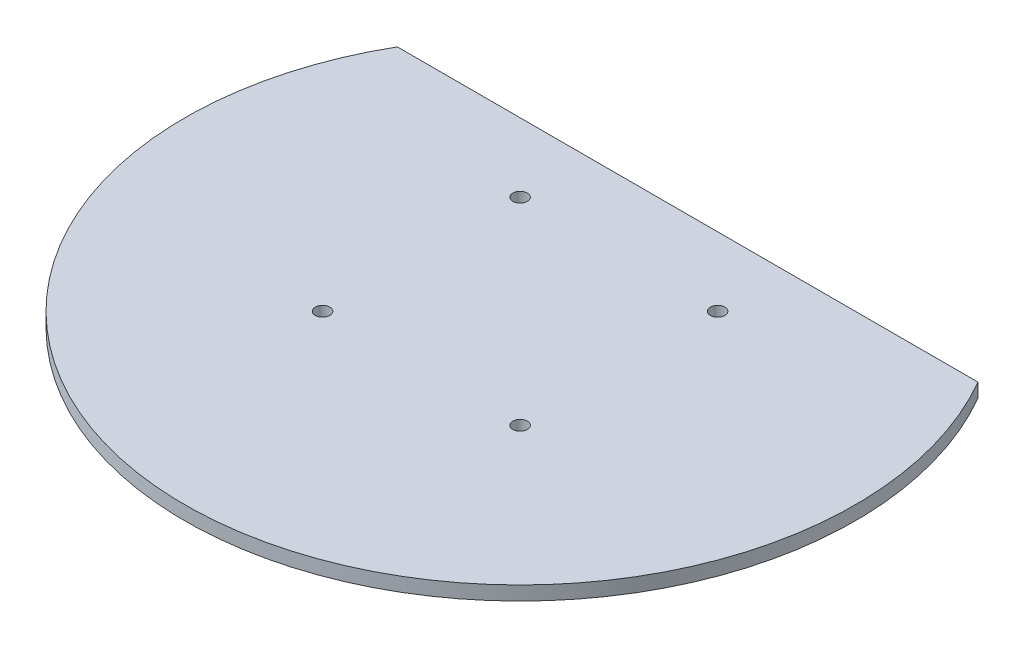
ISO-10303-21;
HEADER;
FILE_DESCRIPTION(('STEP AP214'),'2;1');
FILE_NAME('part.step','',(''),(''),'','','');
FILE_SCHEMA(('AUTOMOTIVE_DESIGN { 1 0 10303 214 1 1 1 1 }'));
ENDSEC;
DATA;
#1=APPLICATION_CONTEXT('core data for automotive mechanical design processes');
#2=APPLICATION_PROTOCOL_DEFINITION('international standard','automotive_design',2000,#1);
#3=PRODUCT_CONTEXT('',#1,'mechanical');
#4=PRODUCT('Part','Part','',(#3));
#5=PRODUCT_RELATED_PRODUCT_CATEGORY('part','',(#4));
#6=PRODUCT_DEFINITION_FORMATION('','',#4);
#7=PRODUCT_DEFINITION_CONTEXT('part definition',#1,'design');
#8=PRODUCT_DEFINITION('design','',#6,#7);
#9=PRODUCT_DEFINITION_SHAPE('','',#8);
#10=(LENGTH_UNIT() NAMED_UNIT(*) SI_UNIT(.MILLI.,.METRE.));
#11=(NAMED_UNIT(*) PLANE_ANGLE_UNIT() SI_UNIT($,.RADIAN.));
#12=(NAMED_UNIT(*) SI_UNIT($,.STERADIAN.) SOLID_ANGLE_UNIT());
#13=UNCERTAINTY_MEASURE_WITH_UNIT(LENGTH_MEASURE(1.E-05),#10,'distance_accuracy_value','');
#14=(GEOMETRIC_REPRESENTATION_CONTEXT(3) GLOBAL_UNCERTAINTY_ASSIGNED_CONTEXT((#13)) GLOBAL_UNIT_ASSIGNED_CONTEXT((#10,
#11,#12)) REPRESENTATION_CONTEXT('',''));
#15=CARTESIAN_POINT('',(0.,0.,0.));
#16=DIRECTION('',(0.,0.,1.));
#17=DIRECTION('',(1.,0.,0.));
#18=AXIS2_PLACEMENT_3D('',#15,#16,#17);
#19=CARTESIAN_POINT('',(0.,6.35,0.));
#20=DIRECTION('',(0.,-1.,0.));
#21=DIRECTION('',(0.,0.,-1.));
#22=AXIS2_PLACEMENT_3D('',#19,#20,#21);
#23=CYLINDRICAL_SURFACE('',#22,152.4);
#24=CARTESIAN_POINT('',(0.,0.,0.));
#25=DIRECTION('',(0.,1.,0.));
#26=DIRECTION('',(0.,0.,1.));
#27=AXIS2_PLACEMENT_3D('',#24,#25,#26);
#28=CIRCLE('',#27,152.4);
#29=CARTESIAN_POINT('',(-131.982271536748,0.,-76.2));
#30=VERTEX_POINT('',#29);
#31=CARTESIAN_POINT('',(131.982271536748,0.,-76.2));
#32=VERTEX_POINT('',#31);
#33=EDGE_CURVE('E62',#30,#32,#28,.T.);
#34=ORIENTED_EDGE('',*,*,#33,.T.);
#35=DIRECTION('',(0.,-1.,0.));
#36=VECTOR('',#35,1.);
#37=CARTESIAN_POINT('',(131.982271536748,6.35,-76.2));
#38=LINE('',#37,#36);
#39=CARTESIAN_POINT('',(131.982271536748,6.35,-76.2));
#40=VERTEX_POINT('',#39);
#41=EDGE_CURVE('E11',#40,#32,#38,.T.);
#42=ORIENTED_EDGE('',*,*,#41,.F.);
#43=CARTESIAN_POINT('',(0.,6.35,0.));
#44=DIRECTION('',(0.,1.,0.));
#45=DIRECTION('',(0.,0.,1.));
#46=AXIS2_PLACEMENT_3D('',#43,#44,#45);
#47=CIRCLE('',#46,152.4);
#48=CARTESIAN_POINT('',(-131.982271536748,6.35,-76.2));
#49=VERTEX_POINT('',#48);
#50=EDGE_CURVE('E61',#49,#40,#47,.T.);
#51=ORIENTED_EDGE('',*,*,#50,.F.);
#52=DIRECTION('',(0.,-1.,0.));
#53=VECTOR('',#52,1.);
#54=CARTESIAN_POINT('',(-131.982271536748,6.35,-76.2));
#55=LINE('',#54,#53);
#56=EDGE_CURVE('E39',#49,#30,#55,.T.);
#57=ORIENTED_EDGE('',*,*,#56,.T.);
#58=EDGE_LOOP('',(#34,#42,#51,#57));
#59=FACE_BOUND('',#58,.T.);
#60=ADVANCED_FACE('F31',(#59),#23,.T.);
#61=CARTESIAN_POINT('',(-131.982271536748,6.35,-76.2));
#62=DIRECTION('',(0.,0.,1.));
#63=DIRECTION('',(1.,0.,0.));
#64=AXIS2_PLACEMENT_3D('',#61,#62,#63);
#65=PLANE('',#64);
#66=DIRECTION('',(-1.,0.,0.));
#67=VECTOR('',#66,1.);
#68=CARTESIAN_POINT('',(-131.982271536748,0.,-76.2));
#69=LINE('',#68,#67);
#70=EDGE_CURVE('E54',#32,#30,#69,.T.);
#71=ORIENTED_EDGE('',*,*,#70,.T.);
#72=ORIENTED_EDGE('',*,*,#56,.F.);
#73=DIRECTION('',(-1.,0.,0.));
#74=VECTOR('',#73,1.);
#75=CARTESIAN_POINT('',(-131.982271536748,6.35,-76.2));
#76=LINE('',#75,#74);
#77=EDGE_CURVE('E46',#40,#49,#76,.T.);
#78=ORIENTED_EDGE('',*,*,#77,.F.);
#79=ORIENTED_EDGE('',*,*,#41,.T.);
#80=EDGE_LOOP('',(#71,#72,#78,#79));
#81=FACE_BOUND('',#80,.T.);
#82=ADVANCED_FACE('F57',(#81),#65,.F.);
#83=CARTESIAN_POINT('',(0.,6.35,0.));
#84=DIRECTION('',(0.,1.,0.));
#85=DIRECTION('',(0.,0.,1.));
#86=AXIS2_PLACEMENT_3D('',#83,#84,#85);
#87=PLANE('',#86);
#88=CARTESIAN_POINT('',(44.901280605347,6.35,44.9012806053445));
#89=DIRECTION('',(0.,1.,0.));
#90=DIRECTION('',(1.,0.,0.));
#91=AXIS2_PLACEMENT_3D('',#88,#89,#90);
#92=CIRCLE('',#91,3.30200000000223);
#93=CARTESIAN_POINT('',(48.2032806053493,6.35,44.9012806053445));
#94=VERTEX_POINT('',#93);
#95=EDGE_CURVE('E86',#94,#94,#92,.T.);
#96=ORIENTED_EDGE('',*,*,#95,.F.);
#97=EDGE_LOOP('',(#96));
#98=FACE_BOUND('',#97,.T.);
#99=CARTESIAN_POINT('',(44.9012806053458,6.35,-44.901280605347));
#100=DIRECTION('',(0.,1.,0.));
#101=DIRECTION('',(1.,0.,0.));
#102=AXIS2_PLACEMENT_3D('',#99,#100,#101);
#103=CIRCLE('',#102,3.30200000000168);
#104=CARTESIAN_POINT('',(48.2032806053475,6.35,-44.901280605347));
#105=VERTEX_POINT('',#104);
#106=EDGE_CURVE('E80',#105,#105,#103,.T.);
#107=ORIENTED_EDGE('',*,*,#106,.F.);
#108=EDGE_LOOP('',(#107));
#109=FACE_BOUND('',#108,.T.);
#110=CARTESIAN_POINT('',(-44.9012806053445,6.35,44.9012806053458));
#111=DIRECTION('',(0.,1.,0.));
#112=DIRECTION('',(1.,0.,0.));
#113=AXIS2_PLACEMENT_3D('',#110,#111,#112);
#114=CIRCLE('',#113,3.30200000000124);
#115=CARTESIAN_POINT('',(-41.5992806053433,6.35,44.9012806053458));
#116=VERTEX_POINT('',#115);
#117=EDGE_CURVE('E75',#116,#116,#114,.T.);
#118=ORIENTED_EDGE('',*,*,#117,.F.);
#119=EDGE_LOOP('',(#118));
#120=FACE_BOUND('',#119,.T.);
#121=CARTESIAN_POINT('',(-44.9012806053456,6.35,-44.901280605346));
#122=DIRECTION('',(0.,1.,0.));
#123=DIRECTION('',(1.,0.,0.));
#124=AXIS2_PLACEMENT_3D('',#121,#122,#123);
#125=CIRCLE('',#124,3.30200000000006);
#126=CARTESIAN_POINT('',(-41.5992806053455,6.35,-44.901280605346));
#127=VERTEX_POINT('',#126);
#128=EDGE_CURVE('E69',#127,#127,#125,.T.);
#129=ORIENTED_EDGE('',*,*,#128,.F.);
#130=EDGE_LOOP('',(#129));
#131=FACE_BOUND('',#130,.T.);
#132=ORIENTED_EDGE('',*,*,#50,.T.);
#133=ORIENTED_EDGE('',*,*,#77,.T.);
#134=EDGE_LOOP('',(#132,#133));
#135=FACE_BOUND('',#134,.T.);
#136=ADVANCED_FACE('F97',(#98,#109,#120,#131,#135),#87,.T.);
#137=CARTESIAN_POINT('',(0.,0.,0.));
#138=DIRECTION('',(0.,1.,0.));
#139=DIRECTION('',(0.,0.,1.));
#140=AXIS2_PLACEMENT_3D('',#137,#138,#139);
#141=PLANE('',#140);
#142=CARTESIAN_POINT('',(44.901280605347,0.,44.9012806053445));
#143=DIRECTION('',(0.,1.,0.));
#144=DIRECTION('',(1.,0.,0.));
#145=AXIS2_PLACEMENT_3D('',#142,#143,#144);
#146=CIRCLE('',#145,3.30200000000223);
#147=CARTESIAN_POINT('',(48.2032806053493,0.,44.9012806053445));
#148=VERTEX_POINT('',#147);
#149=EDGE_CURVE('E89',#148,#148,#146,.T.);
#150=ORIENTED_EDGE('',*,*,#149,.T.);
#151=EDGE_LOOP('',(#150));
#152=FACE_BOUND('',#151,.T.);
#153=CARTESIAN_POINT('',(44.9012806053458,0.,-44.901280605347));
#154=DIRECTION('',(0.,1.,0.));
#155=DIRECTION('',(1.,0.,0.));
#156=AXIS2_PLACEMENT_3D('',#153,#154,#155);
#157=CIRCLE('',#156,3.30200000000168);
#158=CARTESIAN_POINT('',(48.2032806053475,0.,-44.901280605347));
#159=VERTEX_POINT('',#158);
#160=EDGE_CURVE('E83',#159,#159,#157,.T.);
#161=ORIENTED_EDGE('',*,*,#160,.T.);
#162=EDGE_LOOP('',(#161));
#163=FACE_BOUND('',#162,.T.);
#164=CARTESIAN_POINT('',(-44.9012806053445,0.,44.9012806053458));
#165=DIRECTION('',(0.,1.,0.));
#166=DIRECTION('',(1.,0.,0.));
#167=AXIS2_PLACEMENT_3D('',#164,#165,#166);
#168=CIRCLE('',#167,3.30200000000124);
#169=CARTESIAN_POINT('',(-41.5992806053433,0.,44.9012806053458));
#170=VERTEX_POINT('',#169);
#171=EDGE_CURVE('E77',#170,#170,#168,.T.);
#172=ORIENTED_EDGE('',*,*,#171,.T.);
#173=EDGE_LOOP('',(#172));
#174=FACE_BOUND('',#173,.T.);
#175=CARTESIAN_POINT('',(-44.9012806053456,0.,-44.901280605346));
#176=DIRECTION('',(0.,1.,0.));
#177=DIRECTION('',(1.,0.,0.));
#178=AXIS2_PLACEMENT_3D('',#175,#176,#177);
#179=CIRCLE('',#178,3.30200000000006);
#180=CARTESIAN_POINT('',(-41.5992806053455,0.,-44.901280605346));
#181=VERTEX_POINT('',#180);
#182=EDGE_CURVE('E66',#181,#181,#179,.T.);
#183=ORIENTED_EDGE('',*,*,#182,.T.);
#184=EDGE_LOOP('',(#183));
#185=FACE_BOUND('',#184,.T.);
#186=ORIENTED_EDGE('',*,*,#33,.F.);
#187=ORIENTED_EDGE('',*,*,#70,.F.);
#188=EDGE_LOOP('',(#186,#187));
#189=FACE_BOUND('',#188,.T.);
#190=ADVANCED_FACE('F65',(#152,#163,#174,#185,#189),#141,.F.);
#191=CARTESIAN_POINT('',(-44.9012806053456,0.,-44.901280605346));
#192=DIRECTION('',(0.,1.,0.));
#193=DIRECTION('',(0.,0.,1.));
#194=AXIS2_PLACEMENT_3D('',#191,#192,#193);
#195=CYLINDRICAL_SURFACE('',#194,3.30200000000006);
#196=ORIENTED_EDGE('',*,*,#182,.F.);
#197=EDGE_LOOP('',(#196));
#198=FACE_BOUND('',#197,.T.);
#199=ORIENTED_EDGE('',*,*,#128,.T.);
#200=EDGE_LOOP('',(#199));
#201=FACE_BOUND('',#200,.T.);
#202=ADVANCED_FACE('F107',(#198,#201),#195,.F.);
#203=CARTESIAN_POINT('',(-44.9012806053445,0.,44.9012806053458));
#204=DIRECTION('',(0.,1.,0.));
#205=DIRECTION('',(0.,0.,1.));
#206=AXIS2_PLACEMENT_3D('',#203,#204,#205);
#207=CYLINDRICAL_SURFACE('',#206,3.30200000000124);
#208=ORIENTED_EDGE('',*,*,#171,.F.);
#209=EDGE_LOOP('',(#208));
#210=FACE_BOUND('',#209,.T.);
#211=ORIENTED_EDGE('',*,*,#117,.T.);
#212=EDGE_LOOP('',(#211));
#213=FACE_BOUND('',#212,.T.);
#214=ADVANCED_FACE('F109',(#210,#213),#207,.F.);
#215=CARTESIAN_POINT('',(44.9012806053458,0.,-44.901280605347));
#216=DIRECTION('',(0.,1.,0.));
#217=DIRECTION('',(0.,0.,1.));
#218=AXIS2_PLACEMENT_3D('',#215,#216,#217);
#219=CYLINDRICAL_SURFACE('',#218,3.30200000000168);
#220=ORIENTED_EDGE('',*,*,#160,.F.);
#221=EDGE_LOOP('',(#220));
#222=FACE_BOUND('',#221,.T.);
#223=ORIENTED_EDGE('',*,*,#106,.T.);
#224=EDGE_LOOP('',(#223));
#225=FACE_BOUND('',#224,.T.);
#226=ADVANCED_FACE('F116',(#222,#225),#219,.F.);
#227=CARTESIAN_POINT('',(44.901280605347,0.,44.9012806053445));
#228=DIRECTION('',(0.,1.,0.));
#229=DIRECTION('',(0.,0.,1.));
#230=AXIS2_PLACEMENT_3D('',#227,#228,#229);
#231=CYLINDRICAL_SURFACE('',#230,3.30200000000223);
#232=ORIENTED_EDGE('',*,*,#149,.F.);
#233=EDGE_LOOP('',(#232));
#234=FACE_BOUND('',#233,.T.);
#235=ORIENTED_EDGE('',*,*,#95,.T.);
#236=EDGE_LOOP('',(#235));
#237=FACE_BOUND('',#236,.T.);
#238=ADVANCED_FACE('F95',(#234,#237),#231,.F.);
#239=CLOSED_SHELL('',(#60,#82,#136,#190,#202,#214,#226,#238));
#240=MANIFOLD_SOLID_BREP('B2',#239);
#241=ADVANCED_BREP_SHAPE_REPRESENTATION('',(#18,#240),#14);
#242=SHAPE_DEFINITION_REPRESENTATION(#9,#241);
ENDSEC;
END-ISO-10303-21;
